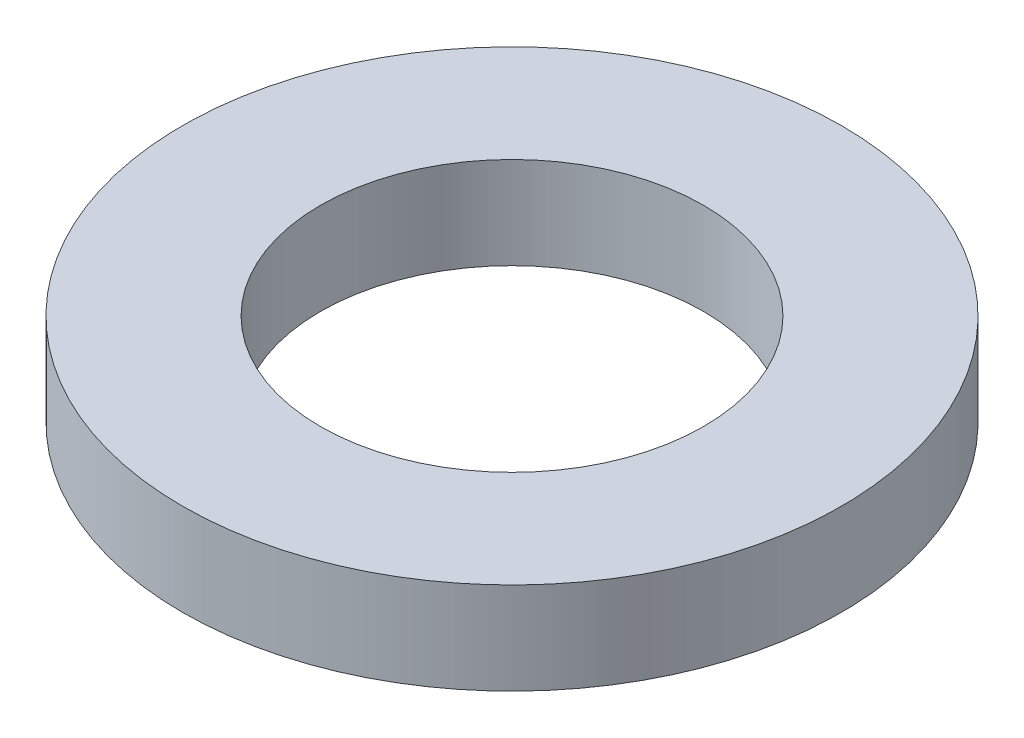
ISO-10303-21;
HEADER;
FILE_DESCRIPTION(('STEP AP214'),'2;1');
FILE_NAME('part.step','',(''),(''),'','','');
FILE_SCHEMA(('AUTOMOTIVE_DESIGN { 1 0 10303 214 1 1 1 1 }'));
ENDSEC;
DATA;
#1=APPLICATION_CONTEXT('core data for automotive mechanical design processes');
#2=APPLICATION_PROTOCOL_DEFINITION('international standard','automotive_design',2000,#1);
#3=PRODUCT_CONTEXT('',#1,'mechanical');
#4=PRODUCT('Part','Part','',(#3));
#5=PRODUCT_RELATED_PRODUCT_CATEGORY('part','',(#4));
#6=PRODUCT_DEFINITION_FORMATION('','',#4);
#7=PRODUCT_DEFINITION_CONTEXT('part definition',#1,'design');
#8=PRODUCT_DEFINITION('design','',#6,#7);
#9=PRODUCT_DEFINITION_SHAPE('','',#8);
#10=(LENGTH_UNIT() NAMED_UNIT(*) SI_UNIT(.MILLI.,.METRE.));
#11=(NAMED_UNIT(*) PLANE_ANGLE_UNIT() SI_UNIT($,.RADIAN.));
#12=(NAMED_UNIT(*) SI_UNIT($,.STERADIAN.) SOLID_ANGLE_UNIT());
#13=UNCERTAINTY_MEASURE_WITH_UNIT(LENGTH_MEASURE(1.E-05),#10,'distance_accuracy_value','');
#14=(GEOMETRIC_REPRESENTATION_CONTEXT(3) GLOBAL_UNCERTAINTY_ASSIGNED_CONTEXT((#13)) GLOBAL_UNIT_ASSIGNED_CONTEXT((#10,
#11,#12)) REPRESENTATION_CONTEXT('',''));
#15=CARTESIAN_POINT('',(0.,0.,0.));
#16=DIRECTION('',(0.,0.,1.));
#17=DIRECTION('',(1.,0.,0.));
#18=AXIS2_PLACEMENT_3D('',#15,#16,#17);
#19=CARTESIAN_POINT('',(0.,12.,0.));
#20=DIRECTION('',(0.,1.,0.));
#21=DIRECTION('',(0.,0.,1.));
#22=AXIS2_PLACEMENT_3D('',#19,#20,#21);
#23=PLANE('',#22);
#24=CARTESIAN_POINT('',(0.,12.,0.));
#25=DIRECTION('',(0.,1.,0.));
#26=DIRECTION('',(0.,0.,1.));
#27=AXIS2_PLACEMENT_3D('',#24,#25,#26);
#28=CIRCLE('',#27,43.);
#29=CARTESIAN_POINT('',(0.,12.,43.));
#30=VERTEX_POINT('',#29);
#31=EDGE_CURVE('E10',#30,#30,#28,.T.);
#32=ORIENTED_EDGE('',*,*,#31,.T.);
#33=EDGE_LOOP('',(#32));
#34=FACE_BOUND('',#33,.T.);
#35=CARTESIAN_POINT('',(0.,12.,0.));
#36=DIRECTION('',(0.,1.,0.));
#37=DIRECTION('',(0.,0.,1.));
#38=AXIS2_PLACEMENT_3D('',#35,#36,#37);
#39=CIRCLE('',#38,25.);
#40=CARTESIAN_POINT('',(0.,12.,25.));
#41=VERTEX_POINT('',#40);
#42=EDGE_CURVE('E42',#41,#41,#39,.T.);
#43=ORIENTED_EDGE('',*,*,#42,.F.);
#44=EDGE_LOOP('',(#43));
#45=FACE_BOUND('',#44,.T.);
#46=ADVANCED_FACE('F31',(#34,#45),#23,.T.);
#47=CARTESIAN_POINT('',(0.,0.,0.));
#48=DIRECTION('',(0.,1.,0.));
#49=DIRECTION('',(0.,0.,1.));
#50=AXIS2_PLACEMENT_3D('',#47,#48,#49);
#51=PLANE('',#50);
#52=CARTESIAN_POINT('',(0.,0.,0.));
#53=DIRECTION('',(0.,1.,0.));
#54=DIRECTION('',(0.,0.,1.));
#55=AXIS2_PLACEMENT_3D('',#52,#53,#54);
#56=CIRCLE('',#55,43.);
#57=CARTESIAN_POINT('',(0.,0.,43.));
#58=VERTEX_POINT('',#57);
#59=EDGE_CURVE('E35',#58,#58,#56,.T.);
#60=ORIENTED_EDGE('',*,*,#59,.F.);
#61=EDGE_LOOP('',(#60));
#62=FACE_BOUND('',#61,.T.);
#63=CARTESIAN_POINT('',(0.,0.,0.));
#64=DIRECTION('',(0.,1.,0.));
#65=DIRECTION('',(0.,0.,1.));
#66=AXIS2_PLACEMENT_3D('',#63,#64,#65);
#67=CIRCLE('',#66,25.);
#68=CARTESIAN_POINT('',(0.,0.,25.));
#69=VERTEX_POINT('',#68);
#70=EDGE_CURVE('E44',#69,#69,#67,.T.);
#71=ORIENTED_EDGE('',*,*,#70,.T.);
#72=EDGE_LOOP('',(#71));
#73=FACE_BOUND('',#72,.T.);
#74=ADVANCED_FACE('F54',(#62,#73),#51,.F.);
#75=CARTESIAN_POINT('',(0.,12.,0.));
#76=DIRECTION('',(0.,-1.,0.));
#77=DIRECTION('',(0.,0.,-1.));
#78=AXIS2_PLACEMENT_3D('',#75,#76,#77);
#79=CYLINDRICAL_SURFACE('',#78,43.);
#80=ORIENTED_EDGE('',*,*,#31,.F.);
#81=EDGE_LOOP('',(#80));
#82=FACE_BOUND('',#81,.T.);
#83=ORIENTED_EDGE('',*,*,#59,.T.);
#84=EDGE_LOOP('',(#83));
#85=FACE_BOUND('',#84,.T.);
#86=ADVANCED_FACE('F33',(#82,#85),#79,.T.);
#87=CARTESIAN_POINT('',(0.,12.,0.));
#88=DIRECTION('',(0.,-1.,0.));
#89=DIRECTION('',(0.,0.,-1.));
#90=AXIS2_PLACEMENT_3D('',#87,#88,#89);
#91=CYLINDRICAL_SURFACE('',#90,25.);
#92=ORIENTED_EDGE('',*,*,#42,.T.);
#93=EDGE_LOOP('',(#92));
#94=FACE_BOUND('',#93,.T.);
#95=ORIENTED_EDGE('',*,*,#70,.F.);
#96=EDGE_LOOP('',(#95));
#97=FACE_BOUND('',#96,.T.);
#98=ADVANCED_FACE('F50',(#94,#97),#91,.F.);
#99=CLOSED_SHELL('',(#46,#74,#86,#98));
#100=MANIFOLD_SOLID_BREP('B2',#99);
#101=ADVANCED_BREP_SHAPE_REPRESENTATION('',(#18,#100),#14);
#102=SHAPE_DEFINITION_REPRESENTATION(#9,#101);
ENDSEC;
END-ISO-10303-21;
